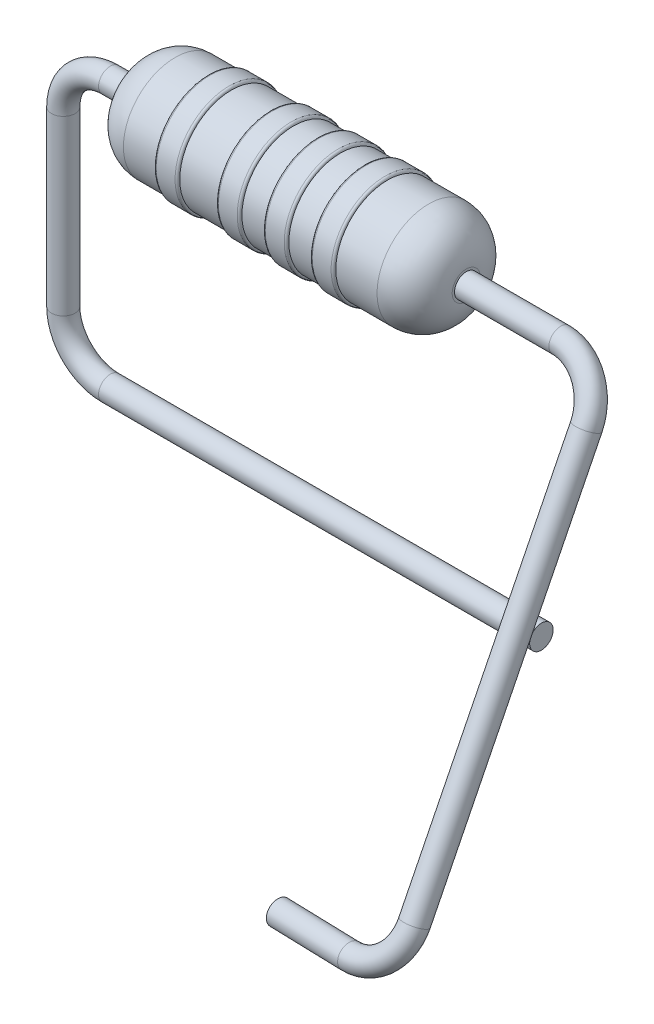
ISO-10303-21;
HEADER;
FILE_DESCRIPTION(('STEP AP214'),'2;1');
FILE_NAME('part.step','',(''),(''),'','','');
FILE_SCHEMA(('AUTOMOTIVE_DESIGN { 1 0 10303 214 1 1 1 1 }'));
ENDSEC;
DATA;
#1=APPLICATION_CONTEXT('core data for automotive mechanical design processes');
#2=APPLICATION_PROTOCOL_DEFINITION('international standard','automotive_design',2000,#1);
#3=PRODUCT_CONTEXT('',#1,'mechanical');
#4=PRODUCT('Part','Part','',(#3));
#5=PRODUCT_RELATED_PRODUCT_CATEGORY('part','',(#4));
#6=PRODUCT_DEFINITION_FORMATION('','',#4);
#7=PRODUCT_DEFINITION_CONTEXT('part definition',#1,'design');
#8=PRODUCT_DEFINITION('design','',#6,#7);
#9=PRODUCT_DEFINITION_SHAPE('','',#8);
#10=(LENGTH_UNIT() NAMED_UNIT(*) SI_UNIT(.MILLI.,.METRE.));
#11=(NAMED_UNIT(*) PLANE_ANGLE_UNIT() SI_UNIT($,.RADIAN.));
#12=(NAMED_UNIT(*) SI_UNIT($,.STERADIAN.) SOLID_ANGLE_UNIT());
#13=UNCERTAINTY_MEASURE_WITH_UNIT(LENGTH_MEASURE(1.E-05),#10,'distance_accuracy_value','');
#14=(GEOMETRIC_REPRESENTATION_CONTEXT(3) GLOBAL_UNCERTAINTY_ASSIGNED_CONTEXT((#13)) GLOBAL_UNIT_ASSIGNED_CONTEXT((#10,
#11,#12)) REPRESENTATION_CONTEXT('',''));
#15=CARTESIAN_POINT('',(0.,0.,0.));
#16=DIRECTION('',(0.,0.,1.));
#17=DIRECTION('',(1.,0.,0.));
#18=AXIS2_PLACEMENT_3D('',#15,#16,#17);
#19=CARTESIAN_POINT('',(3.5,0.299999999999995,0.));
#20=DIRECTION('',(-1.,0.,0.));
#21=DIRECTION('',(0.,0.,1.));
#22=AXIS2_PLACEMENT_3D('',#19,#20,#21);
#23=PLANE('',#22);
#24=CARTESIAN_POINT('',(3.5,0.,0.));
#25=DIRECTION('',(-1.,0.,0.));
#26=DIRECTION('',(0.,0.,1.));
#27=AXIS2_PLACEMENT_3D('',#24,#25,#26);
#28=CIRCLE('',#27,0.299999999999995);
#29=CARTESIAN_POINT('',(3.5,0.,0.299999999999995));
#30=VERTEX_POINT('',#29);
#31=EDGE_CURVE('E71',#30,#30,#28,.T.);
#32=ORIENTED_EDGE('',*,*,#31,.F.);
#33=EDGE_LOOP('',(#32));
#34=FACE_BOUND('',#33,.T.);
#35=CARTESIAN_POINT('',(3.5,0.,0.));
#36=DIRECTION('',(-1.,0.,0.));
#37=DIRECTION('',(0.,0.,1.));
#38=AXIS2_PLACEMENT_3D('',#35,#36,#37);
#39=CIRCLE('',#38,0.25);
#40=CARTESIAN_POINT('',(3.5,0.,0.25));
#41=VERTEX_POINT('',#40);
#42=EDGE_CURVE('E10',#41,#41,#39,.F.);
#43=ORIENTED_EDGE('',*,*,#42,.F.);
#44=EDGE_LOOP('',(#43));
#45=FACE_BOUND('',#44,.T.);
#46=ADVANCED_FACE('F33',(#34,#45),#23,.F.);
#47=CARTESIAN_POINT('',(-3.5,0.,0.));
#48=DIRECTION('',(1.,0.,0.));
#49=DIRECTION('',(0.,0.,-1.));
#50=AXIS2_PLACEMENT_3D('',#47,#48,#49);
#51=PLANE('',#50);
#52=CARTESIAN_POINT('',(-3.5,0.,0.));
#53=DIRECTION('',(-1.,0.,0.));
#54=DIRECTION('',(0.,0.,1.));
#55=AXIS2_PLACEMENT_3D('',#52,#53,#54);
#56=CIRCLE('',#55,0.299999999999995);
#57=CARTESIAN_POINT('',(-3.5,0.,0.299999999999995));
#58=VERTEX_POINT('',#57);
#59=EDGE_CURVE('E95',#58,#58,#56,.T.);
#60=ORIENTED_EDGE('',*,*,#59,.T.);
#61=EDGE_LOOP('',(#60));
#62=FACE_BOUND('',#61,.T.);
#63=CARTESIAN_POINT('',(-3.5,0.,0.));
#64=DIRECTION('',(1.,0.,0.));
#65=DIRECTION('',(0.,0.,-1.));
#66=AXIS2_PLACEMENT_3D('',#63,#64,#65);
#67=CIRCLE('',#66,0.25);
#68=CARTESIAN_POINT('',(-3.5,0.,-0.25));
#69=VERTEX_POINT('',#68);
#70=EDGE_CURVE('E40',#69,#69,#67,.F.);
#71=ORIENTED_EDGE('',*,*,#70,.F.);
#72=EDGE_LOOP('',(#71));
#73=FACE_BOUND('',#72,.T.);
#74=ADVANCED_FACE('F156',(#62,#73),#51,.F.);
#75=CARTESIAN_POINT('',(-54.2686615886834,0.,0.));
#76=DIRECTION('',(-1.,0.,0.));
#77=DIRECTION('',(0.,0.,1.));
#78=AXIS2_PLACEMENT_3D('',#75,#76,#77);
#79=CYLINDRICAL_SURFACE('',#78,1.1);
#80=CARTESIAN_POINT('',(0.322975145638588,0.,0.));
#81=DIRECTION('',(-1.,0.,0.));
#82=DIRECTION('',(0.,0.,1.));
#83=AXIS2_PLACEMENT_3D('',#80,#81,#82);
#84=CIRCLE('',#83,1.1);
#85=CARTESIAN_POINT('',(0.322975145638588,0.,1.1));
#86=VERTEX_POINT('',#85);
#87=EDGE_CURVE('E83',#86,#86,#84,.T.);
#88=ORIENTED_EDGE('',*,*,#87,.T.);
#89=EDGE_LOOP('',(#88));
#90=FACE_BOUND('',#89,.T.);
#91=CARTESIAN_POINT('',(-0.177024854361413,0.,0.));
#92=DIRECTION('',(1.,0.,0.));
#93=DIRECTION('',(0.,0.,-1.));
#94=AXIS2_PLACEMENT_3D('',#91,#92,#93);
#95=CIRCLE('',#94,1.1);
#96=CARTESIAN_POINT('',(-0.177024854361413,0.,-1.1));
#97=VERTEX_POINT('',#96);
#98=EDGE_CURVE('E92',#97,#97,#95,.T.);
#99=ORIENTED_EDGE('',*,*,#98,.T.);
#100=EDGE_LOOP('',(#99));
#101=FACE_BOUND('',#100,.T.);
#102=ADVANCED_FACE('F162',(#90,#101),#79,.T.);
#103=CARTESIAN_POINT('',(4.3261723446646,0.,0.));
#104=DIRECTION('',(1.,0.,0.));
#105=DIRECTION('',(0.,0.,-1.));
#106=AXIS2_PLACEMENT_3D('',#103,#104,#105);
#107=CYLINDRICAL_SURFACE('',#106,1.15);
#108=CARTESIAN_POINT('',(-0.627024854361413,0.,0.));
#109=DIRECTION('',(-1.,0.,0.));
#110=DIRECTION('',(0.,0.,1.));
#111=AXIS2_PLACEMENT_3D('',#108,#109,#110);
#112=CIRCLE('',#111,1.15);
#113=CARTESIAN_POINT('',(-0.627024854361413,0.,1.15));
#114=VERTEX_POINT('',#113);
#115=EDGE_CURVE('E59',#114,#114,#112,.F.);
#116=ORIENTED_EDGE('',*,*,#115,.T.);
#117=EDGE_LOOP('',(#116));
#118=FACE_BOUND('',#117,.T.);
#119=CARTESIAN_POINT('',(-0.227024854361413,0.,0.));
#120=DIRECTION('',(1.,0.,0.));
#121=DIRECTION('',(0.,0.,-1.));
#122=AXIS2_PLACEMENT_3D('',#119,#120,#121);
#123=CIRCLE('',#122,1.15);
#124=CARTESIAN_POINT('',(-0.227024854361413,0.,-1.15));
#125=VERTEX_POINT('',#124);
#126=EDGE_CURVE('E62',#125,#125,#123,.F.);
#127=ORIENTED_EDGE('',*,*,#126,.T.);
#128=EDGE_LOOP('',(#127));
#129=FACE_BOUND('',#128,.T.);
#130=ADVANCED_FACE('F299',(#118,#129),#107,.T.);
#131=CARTESIAN_POINT('',(-1.5,0.,0.));
#132=DIRECTION('',(1.,0.,0.));
#133=DIRECTION('',(0.,0.,-1.));
#134=AXIS2_PLACEMENT_3D('',#131,#132,#133);
#135=CIRCLE('',#134,1.1);
#136=CARTESIAN_POINT('',(-1.5,0.,-1.1));
#137=VERTEX_POINT('',#136);
#138=EDGE_CURVE('E76',#137,#137,#135,.T.);
#139=ORIENTED_EDGE('',*,*,#138,.T.);
#140=EDGE_LOOP('',(#139));
#141=FACE_BOUND('',#140,.T.);
#142=CARTESIAN_POINT('',(-0.677024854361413,0.,0.));
#143=DIRECTION('',(-1.,0.,0.));
#144=DIRECTION('',(0.,0.,1.));
#145=AXIS2_PLACEMENT_3D('',#142,#143,#144);
#146=CIRCLE('',#145,1.1);
#147=CARTESIAN_POINT('',(-0.677024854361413,0.,1.1));
#148=VERTEX_POINT('',#147);
#149=EDGE_CURVE('E89',#148,#148,#146,.T.);
#150=ORIENTED_EDGE('',*,*,#149,.T.);
#151=EDGE_LOOP('',(#150));
#152=FACE_BOUND('',#151,.T.);
#153=ADVANCED_FACE('F257',(#141,#152),#79,.T.);
#154=CARTESIAN_POINT('',(4.3261723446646,0.,0.));
#155=DIRECTION('',(1.,0.,0.));
#156=DIRECTION('',(0.,0.,-1.));
#157=AXIS2_PLACEMENT_3D('',#154,#155,#156);
#158=CYLINDRICAL_SURFACE('',#157,1.15);
#159=CARTESIAN_POINT('',(0.372975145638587,0.,0.));
#160=DIRECTION('',(-1.,0.,0.));
#161=DIRECTION('',(0.,0.,1.));
#162=AXIS2_PLACEMENT_3D('',#159,#160,#161);
#163=CIRCLE('',#162,1.15);
#164=CARTESIAN_POINT('',(0.372975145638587,0.,1.15));
#165=VERTEX_POINT('',#164);
#166=EDGE_CURVE('E53',#165,#165,#163,.F.);
#167=ORIENTED_EDGE('',*,*,#166,.T.);
#168=EDGE_LOOP('',(#167));
#169=FACE_BOUND('',#168,.T.);
#170=CARTESIAN_POINT('',(0.772975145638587,0.,0.));
#171=DIRECTION('',(1.,0.,0.));
#172=DIRECTION('',(0.,0.,-1.));
#173=AXIS2_PLACEMENT_3D('',#170,#171,#172);
#174=CIRCLE('',#173,1.15);
#175=CARTESIAN_POINT('',(0.772975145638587,0.,-1.15));
#176=VERTEX_POINT('',#175);
#177=EDGE_CURVE('E56',#176,#176,#174,.F.);
#178=ORIENTED_EDGE('',*,*,#177,.T.);
#179=EDGE_LOOP('',(#178));
#180=FACE_BOUND('',#179,.T.);
#181=ADVANCED_FACE('F311',(#169,#180),#158,.T.);
#182=CARTESIAN_POINT('',(1.32297514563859,0.,0.));
#183=DIRECTION('',(-1.,0.,0.));
#184=DIRECTION('',(0.,0.,1.));
#185=AXIS2_PLACEMENT_3D('',#182,#183,#184);
#186=CIRCLE('',#185,1.1);
#187=CARTESIAN_POINT('',(1.32297514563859,0.,1.1));
#188=VERTEX_POINT('',#187);
#189=EDGE_CURVE('E75',#188,#188,#186,.T.);
#190=ORIENTED_EDGE('',*,*,#189,.T.);
#191=EDGE_LOOP('',(#190));
#192=FACE_BOUND('',#191,.T.);
#193=CARTESIAN_POINT('',(0.822975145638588,0.,0.));
#194=DIRECTION('',(1.,0.,0.));
#195=DIRECTION('',(0.,0.,-1.));
#196=AXIS2_PLACEMENT_3D('',#193,#194,#195);
#197=CIRCLE('',#196,1.1);
#198=CARTESIAN_POINT('',(0.822975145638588,0.,-1.1));
#199=VERTEX_POINT('',#198);
#200=EDGE_CURVE('E86',#199,#199,#197,.T.);
#201=ORIENTED_EDGE('',*,*,#200,.T.);
#202=EDGE_LOOP('',(#201));
#203=FACE_BOUND('',#202,.T.);
#204=ADVANCED_FACE('F210',(#192,#203),#79,.T.);
#205=CARTESIAN_POINT('',(4.3261723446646,0.,0.));
#206=DIRECTION('',(1.,0.,0.));
#207=DIRECTION('',(0.,0.,-1.));
#208=AXIS2_PLACEMENT_3D('',#205,#206,#207);
#209=CYLINDRICAL_SURFACE('',#208,1.15);
#210=CARTESIAN_POINT('',(1.37297514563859,0.,0.));
#211=DIRECTION('',(-1.,0.,0.));
#212=DIRECTION('',(0.,0.,1.));
#213=AXIS2_PLACEMENT_3D('',#210,#211,#212);
#214=CIRCLE('',#213,1.15);
#215=CARTESIAN_POINT('',(1.37297514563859,0.,1.15));
#216=VERTEX_POINT('',#215);
#217=EDGE_CURVE('E44',#216,#216,#214,.F.);
#218=ORIENTED_EDGE('',*,*,#217,.T.);
#219=EDGE_LOOP('',(#218));
#220=FACE_BOUND('',#219,.T.);
#221=CARTESIAN_POINT('',(1.77297514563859,0.,0.));
#222=DIRECTION('',(1.,0.,0.));
#223=DIRECTION('',(0.,0.,-1.));
#224=AXIS2_PLACEMENT_3D('',#221,#222,#223);
#225=CIRCLE('',#224,1.15);
#226=CARTESIAN_POINT('',(1.77297514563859,0.,-1.15));
#227=VERTEX_POINT('',#226);
#228=EDGE_CURVE('E48',#227,#227,#225,.F.);
#229=ORIENTED_EDGE('',*,*,#228,.T.);
#230=EDGE_LOOP('',(#229));
#231=FACE_BOUND('',#230,.T.);
#232=ADVANCED_FACE('F207',(#220,#231),#209,.T.);
#233=CARTESIAN_POINT('',(2.7,0.,0.));
#234=DIRECTION('',(-1.,0.,0.));
#235=DIRECTION('',(0.,0.,1.));
#236=AXIS2_PLACEMENT_3D('',#233,#234,#235);
#237=DEGENERATE_TOROIDAL_SURFACE('',#236,0.3,0.8,.T.);
#238=CARTESIAN_POINT('',(2.69999999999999,0.,0.));
#239=DIRECTION('',(-1.,0.,0.));
#240=DIRECTION('',(0.,0.,1.));
#241=AXIS2_PLACEMENT_3D('',#238,#239,#240);
#242=CIRCLE('',#241,1.1);
#243=CARTESIAN_POINT('',(2.69999999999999,0.,1.1));
#244=VERTEX_POINT('',#243);
#245=EDGE_CURVE('E100',#244,#244,#242,.T.);
#246=ORIENTED_EDGE('',*,*,#245,.F.);
#247=EDGE_LOOP('',(#246));
#248=FACE_BOUND('',#247,.T.);
#249=ORIENTED_EDGE('',*,*,#31,.T.);
#250=EDGE_LOOP('',(#249));
#251=FACE_BOUND('',#250,.T.);
#252=ADVANCED_FACE('F169',(#248,#251),#237,.T.);
#253=CARTESIAN_POINT('',(1.82297514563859,0.,0.));
#254=DIRECTION('',(1.,0.,0.));
#255=DIRECTION('',(0.,0.,-1.));
#256=AXIS2_PLACEMENT_3D('',#253,#254,#255);
#257=CIRCLE('',#256,1.1);
#258=CARTESIAN_POINT('',(1.82297514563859,0.,-1.1));
#259=VERTEX_POINT('',#258);
#260=EDGE_CURVE('E80',#259,#259,#257,.T.);
#261=ORIENTED_EDGE('',*,*,#260,.T.);
#262=EDGE_LOOP('',(#261));
#263=FACE_BOUND('',#262,.T.);
#264=ORIENTED_EDGE('',*,*,#245,.T.);
#265=EDGE_LOOP('',(#264));
#266=FACE_BOUND('',#265,.T.);
#267=ADVANCED_FACE('F216',(#263,#266),#79,.T.);
#268=CARTESIAN_POINT('',(4.3261723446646,0.,0.));
#269=DIRECTION('',(1.,0.,0.));
#270=DIRECTION('',(0.,0.,-1.));
#271=AXIS2_PLACEMENT_3D('',#268,#269,#270);
#272=CYLINDRICAL_SURFACE('',#271,1.15);
#273=CARTESIAN_POINT('',(-1.95,0.,0.));
#274=DIRECTION('',(-1.,0.,0.));
#275=DIRECTION('',(0.,0.,1.));
#276=AXIS2_PLACEMENT_3D('',#273,#274,#275);
#277=CIRCLE('',#276,1.15);
#278=CARTESIAN_POINT('',(-1.95,0.,1.15));
#279=VERTEX_POINT('',#278);
#280=EDGE_CURVE('E65',#279,#279,#277,.F.);
#281=ORIENTED_EDGE('',*,*,#280,.T.);
#282=EDGE_LOOP('',(#281));
#283=FACE_BOUND('',#282,.T.);
#284=CARTESIAN_POINT('',(-1.55,0.,0.));
#285=DIRECTION('',(1.,0.,0.));
#286=DIRECTION('',(0.,0.,-1.));
#287=AXIS2_PLACEMENT_3D('',#284,#285,#286);
#288=CIRCLE('',#287,1.15);
#289=CARTESIAN_POINT('',(-1.55,0.,-1.15));
#290=VERTEX_POINT('',#289);
#291=EDGE_CURVE('E68',#290,#290,#288,.F.);
#292=ORIENTED_EDGE('',*,*,#291,.T.);
#293=EDGE_LOOP('',(#292));
#294=FACE_BOUND('',#293,.T.);
#295=ADVANCED_FACE('F219',(#283,#294),#272,.T.);
#296=CARTESIAN_POINT('',(-2.7,0.,0.));
#297=DIRECTION('',(-1.,0.,0.));
#298=DIRECTION('',(0.,0.,1.));
#299=AXIS2_PLACEMENT_3D('',#296,#297,#298);
#300=DEGENERATE_TOROIDAL_SURFACE('',#299,0.3,0.8,.T.);
#301=ORIENTED_EDGE('',*,*,#59,.F.);
#302=EDGE_LOOP('',(#301));
#303=FACE_BOUND('',#302,.T.);
#304=CARTESIAN_POINT('',(-2.69999999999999,0.,0.));
#305=DIRECTION('',(-1.,0.,0.));
#306=DIRECTION('',(0.,0.,1.));
#307=AXIS2_PLACEMENT_3D('',#304,#305,#306);
#308=CIRCLE('',#307,1.1);
#309=CARTESIAN_POINT('',(-2.69999999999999,0.,1.1));
#310=VERTEX_POINT('',#309);
#311=EDGE_CURVE('E103',#310,#310,#308,.T.);
#312=ORIENTED_EDGE('',*,*,#311,.T.);
#313=EDGE_LOOP('',(#312));
#314=FACE_BOUND('',#313,.T.);
#315=ADVANCED_FACE('F242',(#303,#314),#300,.T.);
#316=CARTESIAN_POINT('',(-2.,0.,0.));
#317=DIRECTION('',(-1.,0.,0.));
#318=DIRECTION('',(0.,0.,1.));
#319=AXIS2_PLACEMENT_3D('',#316,#317,#318);
#320=CIRCLE('',#319,1.1);
#321=CARTESIAN_POINT('',(-2.,0.,1.1));
#322=VERTEX_POINT('',#321);
#323=EDGE_CURVE('E72',#322,#322,#320,.T.);
#324=ORIENTED_EDGE('',*,*,#323,.T.);
#325=EDGE_LOOP('',(#324));
#326=FACE_BOUND('',#325,.T.);
#327=ORIENTED_EDGE('',*,*,#311,.F.);
#328=EDGE_LOOP('',(#327));
#329=FACE_BOUND('',#328,.T.);
#330=ADVANCED_FACE('F175',(#326,#329),#79,.T.);
#331=CARTESIAN_POINT('',(-1.95,0.,0.));
#332=DIRECTION('',(-1.,0.,0.));
#333=DIRECTION('',(0.,0.,1.));
#334=AXIS2_PLACEMENT_3D('',#331,#332,#333);
#335=TOROIDAL_SURFACE('',#334,1.1,0.05);
#336=ORIENTED_EDGE('',*,*,#323,.F.);
#337=EDGE_LOOP('',(#336));
#338=FACE_BOUND('',#337,.T.);
#339=ORIENTED_EDGE('',*,*,#280,.F.);
#340=EDGE_LOOP('',(#339));
#341=FACE_BOUND('',#340,.T.);
#342=ADVANCED_FACE('F171',(#338,#341),#335,.T.);
#343=CARTESIAN_POINT('',(-1.55,0.,0.));
#344=DIRECTION('',(1.,0.,0.));
#345=DIRECTION('',(0.,0.,-1.));
#346=AXIS2_PLACEMENT_3D('',#343,#344,#345);
#347=TOROIDAL_SURFACE('',#346,1.1,0.05);
#348=ORIENTED_EDGE('',*,*,#291,.F.);
#349=EDGE_LOOP('',(#348));
#350=FACE_BOUND('',#349,.T.);
#351=ORIENTED_EDGE('',*,*,#138,.F.);
#352=EDGE_LOOP('',(#351));
#353=FACE_BOUND('',#352,.T.);
#354=ADVANCED_FACE('F174',(#350,#353),#347,.T.);
#355=CARTESIAN_POINT('',(-0.627024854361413,0.,0.));
#356=DIRECTION('',(-1.,0.,0.));
#357=DIRECTION('',(0.,0.,1.));
#358=AXIS2_PLACEMENT_3D('',#355,#356,#357);
#359=TOROIDAL_SURFACE('',#358,1.1,0.05);
#360=ORIENTED_EDGE('',*,*,#149,.F.);
#361=EDGE_LOOP('',(#360));
#362=FACE_BOUND('',#361,.T.);
#363=ORIENTED_EDGE('',*,*,#115,.F.);
#364=EDGE_LOOP('',(#363));
#365=FACE_BOUND('',#364,.T.);
#366=ADVANCED_FACE('F179',(#362,#365),#359,.T.);
#367=CARTESIAN_POINT('',(-0.227024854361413,0.,0.));
#368=DIRECTION('',(1.,0.,0.));
#369=DIRECTION('',(0.,0.,-1.));
#370=AXIS2_PLACEMENT_3D('',#367,#368,#369);
#371=TOROIDAL_SURFACE('',#370,1.1,0.05);
#372=ORIENTED_EDGE('',*,*,#126,.F.);
#373=EDGE_LOOP('',(#372));
#374=FACE_BOUND('',#373,.T.);
#375=ORIENTED_EDGE('',*,*,#98,.F.);
#376=EDGE_LOOP('',(#375));
#377=FACE_BOUND('',#376,.T.);
#378=ADVANCED_FACE('F183',(#374,#377),#371,.T.);
#379=CARTESIAN_POINT('',(0.372975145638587,0.,0.));
#380=DIRECTION('',(-1.,0.,0.));
#381=DIRECTION('',(0.,0.,1.));
#382=AXIS2_PLACEMENT_3D('',#379,#380,#381);
#383=TOROIDAL_SURFACE('',#382,1.1,0.05);
#384=ORIENTED_EDGE('',*,*,#87,.F.);
#385=EDGE_LOOP('',(#384));
#386=FACE_BOUND('',#385,.T.);
#387=ORIENTED_EDGE('',*,*,#166,.F.);
#388=EDGE_LOOP('',(#387));
#389=FACE_BOUND('',#388,.T.);
#390=ADVANCED_FACE('F187',(#386,#389),#383,.T.);
#391=CARTESIAN_POINT('',(0.772975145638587,0.,0.));
#392=DIRECTION('',(1.,0.,0.));
#393=DIRECTION('',(0.,0.,-1.));
#394=AXIS2_PLACEMENT_3D('',#391,#392,#393);
#395=TOROIDAL_SURFACE('',#394,1.1,0.05);
#396=ORIENTED_EDGE('',*,*,#177,.F.);
#397=EDGE_LOOP('',(#396));
#398=FACE_BOUND('',#397,.T.);
#399=ORIENTED_EDGE('',*,*,#200,.F.);
#400=EDGE_LOOP('',(#399));
#401=FACE_BOUND('',#400,.T.);
#402=ADVANCED_FACE('F191',(#398,#401),#395,.T.);
#403=CARTESIAN_POINT('',(1.37297514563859,0.,0.));
#404=DIRECTION('',(-1.,0.,0.));
#405=DIRECTION('',(0.,0.,1.));
#406=AXIS2_PLACEMENT_3D('',#403,#404,#405);
#407=TOROIDAL_SURFACE('',#406,1.1,0.05);
#408=ORIENTED_EDGE('',*,*,#189,.F.);
#409=EDGE_LOOP('',(#408));
#410=FACE_BOUND('',#409,.T.);
#411=ORIENTED_EDGE('',*,*,#217,.F.);
#412=EDGE_LOOP('',(#411));
#413=FACE_BOUND('',#412,.T.);
#414=ADVANCED_FACE('F194',(#410,#413),#407,.T.);
#415=CARTESIAN_POINT('',(1.77297514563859,0.,0.));
#416=DIRECTION('',(1.,0.,0.));
#417=DIRECTION('',(0.,0.,-1.));
#418=AXIS2_PLACEMENT_3D('',#415,#416,#417);
#419=TOROIDAL_SURFACE('',#418,1.1,0.05);
#420=ORIENTED_EDGE('',*,*,#228,.F.);
#421=EDGE_LOOP('',(#420));
#422=FACE_BOUND('',#421,.T.);
#423=ORIENTED_EDGE('',*,*,#260,.F.);
#424=EDGE_LOOP('',(#423));
#425=FACE_BOUND('',#424,.T.);
#426=ADVANCED_FACE('F35',(#422,#425),#419,.T.);
#427=CARTESIAN_POINT('',(-4.07999999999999,-5.68,0.));
#428=DIRECTION('',(1.,0.,0.));
#429=DIRECTION('',(0.,0.,-1.));
#430=AXIS2_PLACEMENT_3D('',#427,#428,#429);
#431=CYLINDRICAL_SURFACE('',#430,0.25);
#432=CARTESIAN_POINT('',(-4.07999999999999,-5.68,0.));
#433=DIRECTION('',(1.,0.,0.));
#434=DIRECTION('',(0.,0.,1.));
#435=AXIS2_PLACEMENT_3D('',#432,#433,#434);
#436=CIRCLE('',#435,0.25);
#437=CARTESIAN_POINT('',(-4.07999999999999,-5.93,0.));
#438=VERTEX_POINT('',#437);
#439=EDGE_CURVE('E110',#438,#438,#436,.T.);
#440=ORIENTED_EDGE('',*,*,#439,.T.);
#441=EDGE_LOOP('',(#440));
#442=FACE_BOUND('',#441,.T.);
#443=CARTESIAN_POINT('',(5.1,-5.68,0.));
#444=DIRECTION('',(1.,0.,0.));
#445=DIRECTION('',(0.,0.,1.));
#446=AXIS2_PLACEMENT_3D('',#443,#444,#445);
#447=CIRCLE('',#446,0.25);
#448=CARTESIAN_POINT('',(5.1,-5.68,0.25));
#449=VERTEX_POINT('',#448);
#450=EDGE_CURVE('E79',#449,#449,#447,.T.);
#451=ORIENTED_EDGE('',*,*,#450,.F.);
#452=EDGE_LOOP('',(#451));
#453=FACE_BOUND('',#452,.T.);
#454=ADVANCED_FACE('F201',(#442,#453),#431,.T.);
#455=CARTESIAN_POINT('',(-4.08,-4.68,0.));
#456=DIRECTION('',(0.,0.,1.));
#457=DIRECTION('',(1.,0.,0.));
#458=AXIS2_PLACEMENT_3D('',#455,#456,#457);
#459=TOROIDAL_SURFACE('',#458,1.,0.25);
#460=CARTESIAN_POINT('',(-5.08,-4.67999999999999,0.));
#461=DIRECTION('',(0.,-1.,0.));
#462=DIRECTION('',(0.,0.,1.));
#463=AXIS2_PLACEMENT_3D('',#460,#461,#462);
#464=CIRCLE('',#463,0.25);
#465=CARTESIAN_POINT('',(-5.33,-4.67999999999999,0.));
#466=VERTEX_POINT('',#465);
#467=EDGE_CURVE('E113',#466,#466,#464,.T.);
#468=CARTESIAN_POINT('',(-4.08,-4.68,0.));
#469=DIRECTION('',(0.,0.,1.));
#470=DIRECTION('',(1.,0.,0.));
#471=AXIS2_PLACEMENT_3D('',#468,#469,#470);
#472=CIRCLE('',#471,1.25);
#473=EDGE_CURVE('',#466,#438,#472,.T.);
#474=ORIENTED_EDGE('',*,*,#467,.T.);
#475=ORIENTED_EDGE('',*,*,#439,.F.);
#476=ORIENTED_EDGE('',*,*,#473,.T.);
#477=ORIENTED_EDGE('',*,*,#473,.F.);
#478=EDGE_LOOP('',(#474,#476,#475,#477));
#479=FACE_BOUND('',#478,.T.);
#480=ADVANCED_FACE('F364',(#479),#459,.T.);
#481=CARTESIAN_POINT('',(-5.08,-1.00000000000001,0.));
#482=DIRECTION('',(0.,-1.,0.));
#483=DIRECTION('',(1.,0.,0.));
#484=AXIS2_PLACEMENT_3D('',#481,#482,#483);
#485=CYLINDRICAL_SURFACE('',#484,0.25);
#486=CARTESIAN_POINT('',(-5.08,-1.00000000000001,0.));
#487=DIRECTION('',(0.,-1.,0.));
#488=DIRECTION('',(0.,0.,1.));
#489=AXIS2_PLACEMENT_3D('',#486,#487,#488);
#490=CIRCLE('',#489,0.25);
#491=CARTESIAN_POINT('',(-5.33,-1.00000000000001,0.));
#492=VERTEX_POINT('',#491);
#493=EDGE_CURVE('E116',#492,#492,#490,.T.);
#494=ORIENTED_EDGE('',*,*,#493,.T.);
#495=EDGE_LOOP('',(#494));
#496=FACE_BOUND('',#495,.T.);
#497=ORIENTED_EDGE('',*,*,#467,.F.);
#498=EDGE_LOOP('',(#497));
#499=FACE_BOUND('',#498,.T.);
#500=ADVANCED_FACE('F373',(#496,#499),#485,.T.);
#501=CARTESIAN_POINT('',(-4.08,-1.,0.));
#502=DIRECTION('',(0.,0.,1.));
#503=DIRECTION('',(1.,0.,0.));
#504=AXIS2_PLACEMENT_3D('',#501,#502,#503);
#505=TOROIDAL_SURFACE('',#504,1.,0.25);
#506=CARTESIAN_POINT('',(-4.07999999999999,0.,0.));
#507=DIRECTION('',(-1.,0.,0.));
#508=DIRECTION('',(0.,0.,1.));
#509=AXIS2_PLACEMENT_3D('',#506,#507,#508);
#510=CIRCLE('',#509,0.25);
#511=CARTESIAN_POINT('',(-4.07999999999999,0.25,0.));
#512=VERTEX_POINT('',#511);
#513=EDGE_CURVE('E119',#512,#512,#510,.T.);
#514=CARTESIAN_POINT('',(-4.08,-1.,0.));
#515=DIRECTION('',(0.,0.,1.));
#516=DIRECTION('',(1.,0.,0.));
#517=AXIS2_PLACEMENT_3D('',#514,#515,#516);
#518=CIRCLE('',#517,1.25);
#519=EDGE_CURVE('',#512,#492,#518,.T.);
#520=ORIENTED_EDGE('',*,*,#513,.T.);
#521=ORIENTED_EDGE('',*,*,#493,.F.);
#522=ORIENTED_EDGE('',*,*,#519,.T.);
#523=ORIENTED_EDGE('',*,*,#519,.F.);
#524=EDGE_LOOP('',(#520,#522,#521,#523));
#525=FACE_BOUND('',#524,.T.);
#526=ADVANCED_FACE('F382',(#525),#505,.T.);
#527=CARTESIAN_POINT('',(-4.07999999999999,0.,0.));
#528=DIRECTION('',(1.,0.,0.));
#529=DIRECTION('',(0.,0.,-1.));
#530=AXIS2_PLACEMENT_3D('',#527,#528,#529);
#531=CYLINDRICAL_SURFACE('',#530,0.25);
#532=ORIENTED_EDGE('',*,*,#513,.F.);
#533=EDGE_LOOP('',(#532));
#534=FACE_BOUND('',#533,.T.);
#535=ORIENTED_EDGE('',*,*,#70,.T.);
#536=EDGE_LOOP('',(#535));
#537=FACE_BOUND('',#536,.T.);
#538=ADVANCED_FACE('F391',(#534,#537),#531,.T.);
#539=CARTESIAN_POINT('',(5.1,-5.68,0.));
#540=DIRECTION('',(1.,0.,0.));
#541=DIRECTION('',(0.,0.,1.));
#542=AXIS2_PLACEMENT_3D('',#539,#540,#541);
#543=PLANE('',#542);
#544=ORIENTED_EDGE('',*,*,#450,.T.);
#545=EDGE_LOOP('',(#544));
#546=FACE_BOUND('',#545,.T.);
#547=ADVANCED_FACE('F153',(#546),#543,.T.);
#548=CARTESIAN_POINT('',(5.5,0.,0.));
#549=DIRECTION('',(-1.,0.,0.));
#550=DIRECTION('',(0.,0.,1.));
#551=AXIS2_PLACEMENT_3D('',#548,#549,#550);
#552=CYLINDRICAL_SURFACE('',#551,0.25);
#553=ORIENTED_EDGE('',*,*,#42,.T.);
#554=EDGE_LOOP('',(#553));
#555=FACE_BOUND('',#554,.T.);
#556=CARTESIAN_POINT('',(5.50999999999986,0.,0.));
#557=DIRECTION('',(1.,0.,0.));
#558=DIRECTION('',(0.,0.,-1.));
#559=AXIS2_PLACEMENT_3D('',#556,#557,#558);
#560=CIRCLE('',#559,0.25);
#561=CARTESIAN_POINT('',(5.50999999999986,0.223610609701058,-0.111795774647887));
#562=VERTEX_POINT('',#561);
#563=EDGE_CURVE('E131',#562,#562,#560,.T.);
#564=ORIENTED_EDGE('',*,*,#563,.F.);
#565=EDGE_LOOP('',(#564));
#566=FACE_BOUND('',#565,.T.);
#567=ADVANCED_FACE('F143',(#555,#566),#552,.T.);
#568=CARTESIAN_POINT('',(5.51178211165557,-9.11532692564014,4.48735650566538));
#569=DIRECTION('',(-0.99800356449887,-0.0280669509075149,-0.0565785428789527));
#570=DIRECTION('',(-0.0566008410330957,0.,0.998396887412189));
#571=AXIS2_PLACEMENT_3D('',#568,#569,#570);
#572=CYLINDRICAL_SURFACE('',#571,0.25);
#573=CARTESIAN_POINT('',(5.51178211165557,-9.11532692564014,4.48735650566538));
#574=DIRECTION('',(-0.998003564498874,-0.0280669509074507,-0.0565785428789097));
#575=DIRECTION('',(0.0580850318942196,-0.759644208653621,-0.647739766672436));
#576=AXIS2_PLACEMENT_3D('',#573,#574,#575);
#577=CIRCLE('',#576,0.25);
#578=CARTESIAN_POINT('',(5.51173303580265,-9.33893891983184,4.5991495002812));
#579=VERTEX_POINT('',#578);
#580=EDGE_CURVE('E122',#579,#579,#577,.T.);
#581=ORIENTED_EDGE('',*,*,#580,.T.);
#582=EDGE_LOOP('',(#581));
#583=FACE_BOUND('',#582,.T.);
#584=CARTESIAN_POINT('',(3.9031942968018,-9.16056539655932,4.39616288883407));
#585=DIRECTION('',(-0.998003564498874,-0.0280669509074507,-0.0565785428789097));
#586=DIRECTION('',(-0.0566008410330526,0.,0.998396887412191));
#587=AXIS2_PLACEMENT_3D('',#584,#585,#586);
#588=CIRCLE('',#587,0.249999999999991);
#589=CARTESIAN_POINT('',(3.88904408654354,-9.16056539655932,4.64576211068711));
#590=VERTEX_POINT('',#589);
#591=EDGE_CURVE('E134',#590,#590,#588,.T.);
#592=ORIENTED_EDGE('',*,*,#591,.F.);
#593=EDGE_LOOP('',(#592));
#594=FACE_BOUND('',#593,.T.);
#595=ADVANCED_FACE('F140',(#583,#594),#572,.T.);
#596=CARTESIAN_POINT('',(5.5119764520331,-8.22982342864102,4.04465624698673));
#597=DIRECTION('',(0.0631573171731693,-0.446290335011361,-0.892656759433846));
#598=DIRECTION('',(0.,0.894442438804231,-0.44718309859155));
#599=AXIS2_PLACEMENT_3D('',#596,#597,#598);
#600=TOROIDAL_SURFACE('',#599,0.99,0.25);
#601=CARTESIAN_POINT('',(6.49999999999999,-8.2018629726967,4.10058192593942));
#602=DIRECTION('',(0.,-0.894442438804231,0.447183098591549));
#603=DIRECTION('',(0.447183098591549,-0.399979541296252,-0.800027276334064));
#604=AXIS2_PLACEMENT_3D('',#601,#602,#603);
#605=CIRCLE('',#604,0.25);
#606=CARTESIAN_POINT('',(6.74950089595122,-8.19480225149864,4.11470457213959));
#607=VERTEX_POINT('',#606);
#608=EDGE_CURVE('E125',#607,#607,#605,.T.);
#609=CARTESIAN_POINT('',(5.5119764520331,-8.22982342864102,4.04465624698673));
#610=DIRECTION('',(0.0631573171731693,-0.446290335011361,-0.892656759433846));
#611=DIRECTION('',(0.,0.894442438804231,-0.44718309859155));
#612=AXIS2_PLACEMENT_3D('',#609,#610,#611);
#613=CIRCLE('',#612,1.24);
#614=EDGE_CURVE('',#607,#579,#613,.T.);
#615=ORIENTED_EDGE('',*,*,#608,.T.);
#616=ORIENTED_EDGE('',*,*,#580,.F.);
#617=ORIENTED_EDGE('',*,*,#614,.T.);
#618=ORIENTED_EDGE('',*,*,#614,.F.);
#619=EDGE_LOOP('',(#615,#617,#616,#618));
#620=FACE_BOUND('',#619,.T.);
#621=ADVANCED_FACE('F142',(#620),#600,.T.);
#622=CARTESIAN_POINT('',(6.49999999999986,-0.885498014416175,0.442711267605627));
#623=DIRECTION('',(0.,-0.894442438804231,0.447183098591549));
#624=DIRECTION('',(0.,-0.447183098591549,-0.894442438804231));
#625=AXIS2_PLACEMENT_3D('',#622,#623,#624);
#626=CYLINDRICAL_SURFACE('',#625,0.25);
#627=CARTESIAN_POINT('',(6.49999999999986,-0.885498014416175,0.442711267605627));
#628=DIRECTION('',(0.,-0.894442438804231,0.447183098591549));
#629=DIRECTION('',(0.447183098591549,-0.399979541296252,-0.800027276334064));
#630=AXIS2_PLACEMENT_3D('',#627,#628,#629);
#631=CIRCLE('',#630,0.25);
#632=CARTESIAN_POINT('',(6.74999999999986,-0.885498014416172,0.442711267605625));
#633=VERTEX_POINT('',#632);
#634=EDGE_CURVE('E128',#633,#633,#631,.T.);
#635=ORIENTED_EDGE('',*,*,#634,.T.);
#636=EDGE_LOOP('',(#635));
#637=FACE_BOUND('',#636,.T.);
#638=ORIENTED_EDGE('',*,*,#608,.F.);
#639=EDGE_LOOP('',(#638));
#640=FACE_BOUND('',#639,.T.);
#641=ADVANCED_FACE('F150',(#637,#640),#626,.T.);
#642=CARTESIAN_POINT('',(5.50999999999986,-0.885498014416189,0.442711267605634));
#643=DIRECTION('',(0.,-0.447183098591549,-0.894442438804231));
#644=DIRECTION('',(0.,0.894442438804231,-0.447183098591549));
#645=AXIS2_PLACEMENT_3D('',#642,#643,#644);
#646=TOROIDAL_SURFACE('',#645,0.99,0.25);
#647=CARTESIAN_POINT('',(5.50999999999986,-0.885498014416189,0.442711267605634));
#648=DIRECTION('',(0.,-0.447183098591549,-0.894442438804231));
#649=DIRECTION('',(0.,0.894442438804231,-0.447183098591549));
#650=AXIS2_PLACEMENT_3D('',#647,#648,#649);
#651=CIRCLE('',#650,1.24);
#652=EDGE_CURVE('',#562,#633,#651,.T.);
#653=ORIENTED_EDGE('',*,*,#563,.T.);
#654=ORIENTED_EDGE('',*,*,#634,.F.);
#655=ORIENTED_EDGE('',*,*,#652,.T.);
#656=ORIENTED_EDGE('',*,*,#652,.F.);
#657=EDGE_LOOP('',(#653,#655,#654,#656));
#658=FACE_BOUND('',#657,.T.);
#659=ADVANCED_FACE('F440',(#658),#646,.T.);
#660=CARTESIAN_POINT('',(3.9031942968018,-9.16056539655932,4.39616288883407));
#661=DIRECTION('',(-0.998003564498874,-0.0280669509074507,-0.0565785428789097));
#662=DIRECTION('',(-0.0566008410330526,0.,0.998396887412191));
#663=AXIS2_PLACEMENT_3D('',#660,#661,#662);
#664=PLANE('',#663);
#665=ORIENTED_EDGE('',*,*,#591,.T.);
#666=EDGE_LOOP('',(#665));
#667=FACE_BOUND('',#666,.T.);
#668=ADVANCED_FACE('F138',(#667),#664,.T.);
#669=CLOSED_SHELL('',(#46,#74,#102,#130,#153,#181,#204,#232,#252,#267,#295,#315,#330,#342,#354,
#366,#378,#390,#402,#414,#426,#454,#480,#500,#526,#538,#547,#567,#595,#621,#641,#659,#668));
#670=MANIFOLD_SOLID_BREP('B2',#669);
#671=ADVANCED_BREP_SHAPE_REPRESENTATION('',(#18,#670),#14);
#672=SHAPE_DEFINITION_REPRESENTATION(#9,#671);
ENDSEC;
END-ISO-10303-21;
